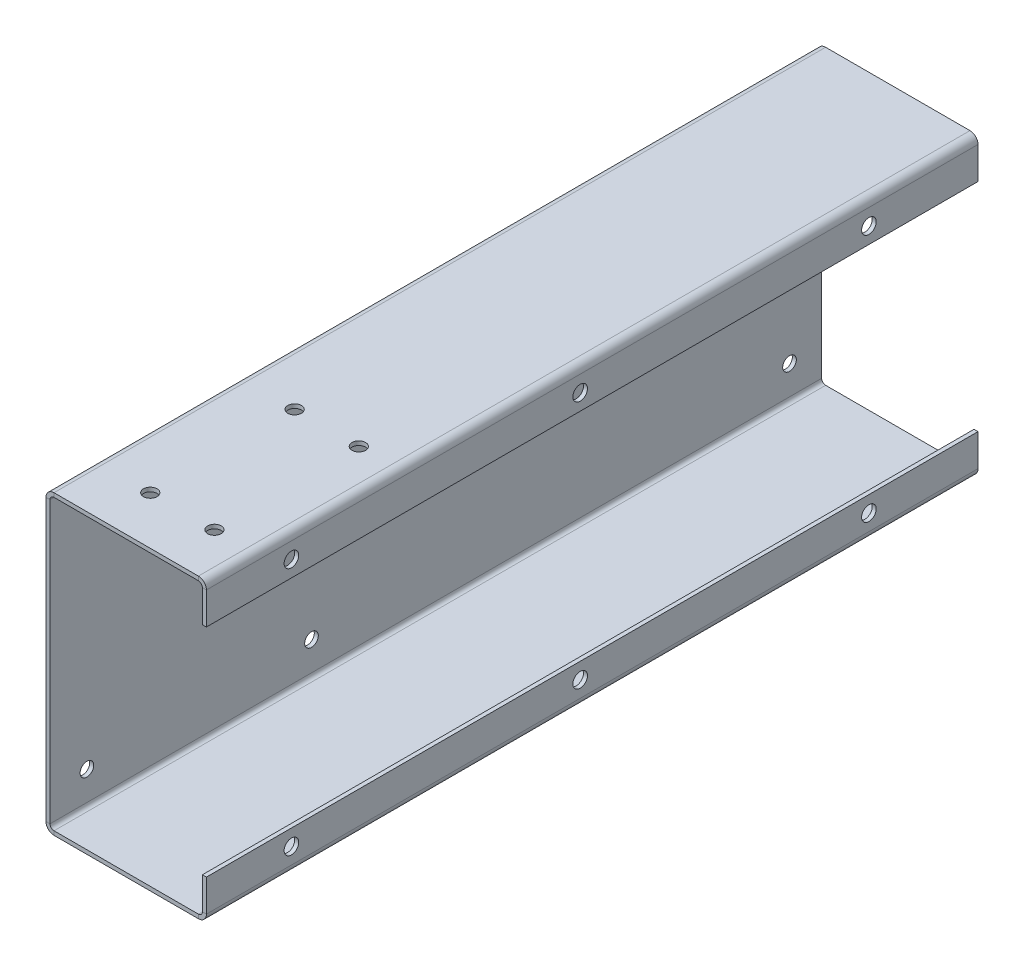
ISO-10303-21;
HEADER;
FILE_DESCRIPTION(('STEP AP214'),'2;1');
FILE_NAME('part.step','',(''),(''),'','','');
FILE_SCHEMA(('AUTOMOTIVE_DESIGN { 1 0 10303 214 1 1 1 1 }'));
ENDSEC;
DATA;
#1=APPLICATION_CONTEXT('core data for automotive mechanical design processes');
#2=APPLICATION_PROTOCOL_DEFINITION('international standard','automotive_design',2000,#1);
#3=PRODUCT_CONTEXT('',#1,'mechanical');
#4=PRODUCT('Part','Part','',(#3));
#5=PRODUCT_RELATED_PRODUCT_CATEGORY('part','',(#4));
#6=PRODUCT_DEFINITION_FORMATION('','',#4);
#7=PRODUCT_DEFINITION_CONTEXT('part definition',#1,'design');
#8=PRODUCT_DEFINITION('design','',#6,#7);
#9=PRODUCT_DEFINITION_SHAPE('','',#8);
#10=(LENGTH_UNIT() NAMED_UNIT(*) SI_UNIT(.MILLI.,.METRE.));
#11=(NAMED_UNIT(*) PLANE_ANGLE_UNIT() SI_UNIT($,.RADIAN.));
#12=(NAMED_UNIT(*) SI_UNIT($,.STERADIAN.) SOLID_ANGLE_UNIT());
#13=UNCERTAINTY_MEASURE_WITH_UNIT(LENGTH_MEASURE(1.E-05),#10,'distance_accuracy_value','');
#14=(GEOMETRIC_REPRESENTATION_CONTEXT(3) GLOBAL_UNCERTAINTY_ASSIGNED_CONTEXT((#13)) GLOBAL_UNIT_ASSIGNED_CONTEXT((#10,
#11,#12)) REPRESENTATION_CONTEXT('',''));
#15=CARTESIAN_POINT('',(0.,0.,0.));
#16=DIRECTION('',(0.,0.,1.));
#17=DIRECTION('',(1.,0.,0.));
#18=AXIS2_PLACEMENT_3D('',#15,#16,#17);
#19=CARTESIAN_POINT('',(2.50000000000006,0.,481.));
#20=DIRECTION('',(-1.,0.,0.));
#21=DIRECTION('',(0.,0.,1.));
#22=AXIS2_PLACEMENT_3D('',#19,#20,#21);
#23=PLANE('',#22);
#24=CARTESIAN_POINT('',(2.49999999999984,23.0000000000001,318.));
#25=DIRECTION('',(1.,0.,0.));
#26=DIRECTION('',(0.,0.,-1.));
#27=AXIS2_PLACEMENT_3D('',#24,#25,#26);
#28=CIRCLE('',#27,4.24999999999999);
#29=CARTESIAN_POINT('',(2.49999999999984,23.0000000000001,313.75));
#30=VERTEX_POINT('',#29);
#31=EDGE_CURVE('E506',#30,#30,#28,.T.);
#32=ORIENTED_EDGE('',*,*,#31,.F.);
#33=EDGE_LOOP('',(#32));
#34=FACE_BOUND('',#33,.T.);
#35=DIRECTION('',(0.,1.,0.));
#36=VECTOR('',#35,1.);
#37=CARTESIAN_POINT('',(2.5,0.,0.));
#38=LINE('',#37,#36);
#39=CARTESIAN_POINT('',(2.49999999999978,5.00000000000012,0.));
#40=VERTEX_POINT('',#39);
#41=CARTESIAN_POINT('',(2.5,180.,0.));
#42=VERTEX_POINT('',#41);
#43=EDGE_CURVE('E265',#40,#42,#38,.T.);
#44=ORIENTED_EDGE('',*,*,#43,.T.);
#45=DIRECTION('',(0.,0.,-1.));
#46=VECTOR('',#45,1.);
#47=CARTESIAN_POINT('',(2.49999999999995,180.,480.999999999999));
#48=LINE('',#47,#46);
#49=CARTESIAN_POINT('',(2.49999999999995,180.,480.999999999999));
#50=VERTEX_POINT('',#49);
#51=EDGE_CURVE('E365',#50,#42,#48,.T.);
#52=ORIENTED_EDGE('',*,*,#51,.F.);
#53=DIRECTION('',(0.,1.,0.));
#54=VECTOR('',#53,1.);
#55=CARTESIAN_POINT('',(2.50000000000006,0.,481.));
#56=LINE('',#55,#54);
#57=CARTESIAN_POINT('',(2.49999999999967,4.99999999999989,481.));
#58=VERTEX_POINT('',#57);
#59=EDGE_CURVE('E342',#58,#50,#56,.T.);
#60=ORIENTED_EDGE('',*,*,#59,.F.);
#61=DIRECTION('',(0.,0.,-1.));
#62=VECTOR('',#61,1.);
#63=CARTESIAN_POINT('',(2.49999999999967,4.99999999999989,481.));
#64=LINE('',#63,#62);
#65=EDGE_CURVE('E369',#58,#40,#64,.T.);
#66=ORIENTED_EDGE('',*,*,#65,.T.);
#67=EDGE_LOOP('',(#44,#52,#60,#66));
#68=FACE_BOUND('',#67,.T.);
#69=CARTESIAN_POINT('',(2.49999999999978,23.0000000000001,458.));
#70=DIRECTION('',(1.,0.,0.));
#71=DIRECTION('',(0.,0.,-1.));
#72=AXIS2_PLACEMENT_3D('',#69,#70,#71);
#73=CIRCLE('',#72,4.24999999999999);
#74=CARTESIAN_POINT('',(2.49999999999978,23.0000000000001,453.75));
#75=VERTEX_POINT('',#74);
#76=EDGE_CURVE('E514',#75,#75,#73,.T.);
#77=ORIENTED_EDGE('',*,*,#76,.F.);
#78=EDGE_LOOP('',(#77));
#79=FACE_BOUND('',#78,.T.);
#80=CARTESIAN_POINT('',(2.49999999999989,23.0000000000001,19.9999999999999));
#81=DIRECTION('',(1.,0.,0.));
#82=DIRECTION('',(0.,0.,-1.));
#83=AXIS2_PLACEMENT_3D('',#80,#81,#82);
#84=CIRCLE('',#83,4.24999999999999);
#85=CARTESIAN_POINT('',(2.49999999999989,23.0000000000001,15.7499999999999));
#86=VERTEX_POINT('',#85);
#87=EDGE_CURVE('E470',#86,#86,#84,.T.);
#88=ORIENTED_EDGE('',*,*,#87,.F.);
#89=EDGE_LOOP('',(#88));
#90=FACE_BOUND('',#89,.T.);
#91=ADVANCED_FACE('F38',(#34,#68,#79,#90),#23,.F.);
#92=CARTESIAN_POINT('',(95.,0.,481.));
#93=DIRECTION('',(0.,0.,1.));
#94=DIRECTION('',(1.,0.,0.));
#95=AXIS2_PLACEMENT_3D('',#92,#93,#94);
#96=PLANE('',#95);
#97=DIRECTION('',(0.,1.,0.));
#98=VECTOR('',#97,1.);
#99=CARTESIAN_POINT('',(95.,0.,481.));
#100=LINE('',#99,#98);
#101=CARTESIAN_POINT('',(95.,0.,481.));
#102=VERTEX_POINT('',#101);
#103=CARTESIAN_POINT('',(94.9999999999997,2.50000000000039,481.));
#104=VERTEX_POINT('',#103);
#105=EDGE_CURVE('E11',#102,#104,#100,.T.);
#106=ORIENTED_EDGE('',*,*,#105,.F.);
#107=CARTESIAN_POINT('',(94.9999999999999,5.00000000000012,481.));
#108=DIRECTION('',(0.,0.,1.));
#109=DIRECTION('',(1.,0.,0.));
#110=AXIS2_PLACEMENT_3D('',#107,#108,#109);
#111=CIRCLE('',#110,5.);
#112=CARTESIAN_POINT('',(99.9999999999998,4.99999999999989,481.));
#113=VERTEX_POINT('',#112);
#114=EDGE_CURVE('E314',#113,#102,#111,.F.);
#115=ORIENTED_EDGE('',*,*,#114,.F.);
#116=DIRECTION('',(1.,0.,0.));
#117=VECTOR('',#116,1.);
#118=CARTESIAN_POINT('',(97.4999999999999,5.00000000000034,481.));
#119=LINE('',#118,#117);
#120=CARTESIAN_POINT('',(97.4999999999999,5.00000000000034,481.));
#121=VERTEX_POINT('',#120);
#122=EDGE_CURVE('E48',#121,#113,#119,.T.);
#123=ORIENTED_EDGE('',*,*,#122,.F.);
#124=CARTESIAN_POINT('',(94.9999999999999,5.00000000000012,481.));
#125=DIRECTION('',(0.,0.,1.));
#126=DIRECTION('',(1.,0.,0.));
#127=AXIS2_PLACEMENT_3D('',#124,#125,#126);
#128=CIRCLE('',#127,2.5);
#129=EDGE_CURVE('E330',#121,#104,#128,.F.);
#130=ORIENTED_EDGE('',*,*,#129,.T.);
#131=EDGE_LOOP('',(#106,#115,#123,#130));
#132=FACE_BOUND('',#131,.T.);
#133=ADVANCED_FACE('F40',(#132),#96,.T.);
#134=CARTESIAN_POINT('',(97.4999999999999,5.00000000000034,481.));
#135=DIRECTION('',(0.,0.,1.));
#136=DIRECTION('',(1.,0.,0.));
#137=AXIS2_PLACEMENT_3D('',#134,#135,#136);
#138=PLANE('',#137);
#139=DIRECTION('',(-1.,0.,0.));
#140=VECTOR('',#139,1.);
#141=CARTESIAN_POINT('',(99.9999999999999,0.,481.));
#142=LINE('',#141,#140);
#143=CARTESIAN_POINT('',(5.00000000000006,0.,481.));
#144=VERTEX_POINT('',#143);
#145=EDGE_CURVE('E310',#102,#144,#142,.T.);
#146=ORIENTED_EDGE('',*,*,#145,.F.);
#147=ORIENTED_EDGE('',*,*,#105,.T.);
#148=DIRECTION('',(-1.,0.,0.));
#149=VECTOR('',#148,1.);
#150=CARTESIAN_POINT('',(99.9999999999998,2.49999999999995,481.));
#151=LINE('',#150,#149);
#152=CARTESIAN_POINT('',(4.99999999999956,2.49999999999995,481.));
#153=VERTEX_POINT('',#152);
#154=EDGE_CURVE('E334',#104,#153,#151,.T.);
#155=ORIENTED_EDGE('',*,*,#154,.T.);
#156=DIRECTION('',(0.,-1.,0.));
#157=VECTOR('',#156,1.);
#158=CARTESIAN_POINT('',(4.99999999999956,2.49999999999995,481.));
#159=LINE('',#158,#157);
#160=EDGE_CURVE('E452',#153,#144,#159,.T.);
#161=ORIENTED_EDGE('',*,*,#160,.T.);
#162=EDGE_LOOP('',(#146,#147,#155,#161));
#163=FACE_BOUND('',#162,.T.);
#164=ADVANCED_FACE('F660',(#163),#138,.T.);
#165=CARTESIAN_POINT('',(99.9999999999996,5.00000000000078,-3.33066907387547E-13));
#166=DIRECTION('',(0.,0.,-1.));
#167=DIRECTION('',(-1.,0.,0.));
#168=AXIS2_PLACEMENT_3D('',#165,#166,#167);
#169=PLANE('',#168);
#170=DIRECTION('',(-1.,0.,0.));
#171=VECTOR('',#170,1.);
#172=CARTESIAN_POINT('',(99.9999999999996,5.00000000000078,-3.33066907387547E-13));
#173=LINE('',#172,#171);
#174=CARTESIAN_POINT('',(99.9999999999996,5.00000000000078,-3.33066907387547E-13));
#175=VERTEX_POINT('',#174);
#176=CARTESIAN_POINT('',(97.4999999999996,5.00000000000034,-1.11022302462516E-13));
#177=VERTEX_POINT('',#176);
#178=EDGE_CURVE('E461',#175,#177,#173,.T.);
#179=ORIENTED_EDGE('',*,*,#178,.F.);
#180=CARTESIAN_POINT('',(94.9999999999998,5.00000000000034,-1.66533453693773E-13));
#181=DIRECTION('',(0.,0.,1.));
#182=DIRECTION('',(1.,0.,0.));
#183=AXIS2_PLACEMENT_3D('',#180,#181,#182);
#184=CIRCLE('',#183,5.);
#185=CARTESIAN_POINT('',(95.0000000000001,2.22044604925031E-13,0.));
#186=VERTEX_POINT('',#185);
#187=EDGE_CURVE('E237',#175,#186,#184,.F.);
#188=ORIENTED_EDGE('',*,*,#187,.T.);
#189=DIRECTION('',(0.,-1.,0.));
#190=VECTOR('',#189,1.);
#191=CARTESIAN_POINT('',(94.9999999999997,2.50000000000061,-1.66533453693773E-13));
#192=LINE('',#191,#190);
#193=CARTESIAN_POINT('',(94.9999999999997,2.50000000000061,-1.66533453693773E-13));
#194=VERTEX_POINT('',#193);
#195=EDGE_CURVE('E458',#194,#186,#192,.T.);
#196=ORIENTED_EDGE('',*,*,#195,.F.);
#197=CARTESIAN_POINT('',(94.9999999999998,5.00000000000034,-1.66533453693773E-13));
#198=DIRECTION('',(0.,0.,1.));
#199=DIRECTION('',(1.,0.,0.));
#200=AXIS2_PLACEMENT_3D('',#197,#198,#199);
#201=CIRCLE('',#200,2.5);
#202=EDGE_CURVE('E253',#177,#194,#201,.F.);
#203=ORIENTED_EDGE('',*,*,#202,.F.);
#204=EDGE_LOOP('',(#179,#188,#196,#203));
#205=FACE_BOUND('',#204,.T.);
#206=ADVANCED_FACE('F630',(#205),#169,.T.);
#207=CARTESIAN_POINT('',(94.9999999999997,2.50000000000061,-1.66533453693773E-13));
#208=DIRECTION('',(0.,0.,-1.));
#209=DIRECTION('',(-1.,0.,0.));
#210=AXIS2_PLACEMENT_3D('',#207,#208,#209);
#211=PLANE('',#210);
#212=DIRECTION('',(0.,-1.,0.));
#213=VECTOR('',#212,1.);
#214=CARTESIAN_POINT('',(100.,25.0000000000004,-1.66533453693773E-13));
#215=LINE('',#214,#213);
#216=CARTESIAN_POINT('',(100.,25.0000000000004,-1.66533453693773E-13));
#217=VERTEX_POINT('',#216);
#218=EDGE_CURVE('E241',#217,#175,#215,.T.);
#219=ORIENTED_EDGE('',*,*,#218,.T.);
#220=ORIENTED_EDGE('',*,*,#178,.T.);
#221=DIRECTION('',(0.,1.,0.));
#222=VECTOR('',#221,1.);
#223=CARTESIAN_POINT('',(97.5,25.0000000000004,0.));
#224=LINE('',#223,#222);
#225=CARTESIAN_POINT('',(97.5,25.0000000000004,0.));
#226=VERTEX_POINT('',#225);
#227=EDGE_CURVE('E249',#226,#177,#224,.F.);
#228=ORIENTED_EDGE('',*,*,#227,.F.);
#229=DIRECTION('',(1.,0.,0.));
#230=VECTOR('',#229,1.);
#231=CARTESIAN_POINT('',(97.5,25.0000000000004,0.));
#232=LINE('',#231,#230);
#233=EDGE_CURVE('E245',#226,#217,#232,.T.);
#234=ORIENTED_EDGE('',*,*,#233,.T.);
#235=EDGE_LOOP('',(#219,#220,#228,#234));
#236=FACE_BOUND('',#235,.T.);
#237=ADVANCED_FACE('F638',(#236),#211,.T.);
#238=CARTESIAN_POINT('',(-2.77555756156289E-13,5.00000000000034,481.));
#239=DIRECTION('',(0.,0.,1.));
#240=DIRECTION('',(1.,0.,0.));
#241=AXIS2_PLACEMENT_3D('',#238,#239,#240);
#242=PLANE('',#241);
#243=DIRECTION('',(1.,0.,0.));
#244=VECTOR('',#243,1.);
#245=CARTESIAN_POINT('',(-2.77555756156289E-13,5.00000000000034,481.));
#246=LINE('',#245,#244);
#247=CARTESIAN_POINT('',(-2.77555756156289E-13,5.00000000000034,481.));
#248=VERTEX_POINT('',#247);
#249=EDGE_CURVE('E455',#248,#58,#246,.T.);
#250=ORIENTED_EDGE('',*,*,#249,.F.);
#251=CARTESIAN_POINT('',(4.99999999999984,5.00000000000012,481.));
#252=DIRECTION('',(0.,0.,1.));
#253=DIRECTION('',(1.,0.,0.));
#254=AXIS2_PLACEMENT_3D('',#251,#252,#253);
#255=CIRCLE('',#254,5.);
#256=EDGE_CURVE('E306',#144,#248,#255,.F.);
#257=ORIENTED_EDGE('',*,*,#256,.F.);
#258=ORIENTED_EDGE('',*,*,#160,.F.);
#259=CARTESIAN_POINT('',(4.99999999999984,5.00000000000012,481.));
#260=DIRECTION('',(0.,0.,1.));
#261=DIRECTION('',(1.,0.,0.));
#262=AXIS2_PLACEMENT_3D('',#259,#260,#261);
#263=CIRCLE('',#262,2.5);
#264=EDGE_CURVE('E338',#153,#58,#263,.F.);
#265=ORIENTED_EDGE('',*,*,#264,.T.);
#266=EDGE_LOOP('',(#250,#257,#258,#265));
#267=FACE_BOUND('',#266,.T.);
#268=ADVANCED_FACE('F663',(#267),#242,.T.);
#269=CARTESIAN_POINT('',(4.99999999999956,2.49999999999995,481.));
#270=DIRECTION('',(0.,0.,1.));
#271=DIRECTION('',(1.,0.,0.));
#272=AXIS2_PLACEMENT_3D('',#269,#270,#271);
#273=PLANE('',#272);
#274=DIRECTION('',(0.,1.,0.));
#275=VECTOR('',#274,1.);
#276=CARTESIAN_POINT('',(-1.11022302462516E-13,0.,481.));
#277=LINE('',#276,#275);
#278=CARTESIAN_POINT('',(0.,180.,481.));
#279=VERTEX_POINT('',#278);
#280=EDGE_CURVE('E302',#248,#279,#277,.T.);
#281=ORIENTED_EDGE('',*,*,#280,.F.);
#282=ORIENTED_EDGE('',*,*,#249,.T.);
#283=ORIENTED_EDGE('',*,*,#59,.T.);
#284=DIRECTION('',(-1.,0.,0.));
#285=VECTOR('',#284,1.);
#286=CARTESIAN_POINT('',(2.49999999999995,180.,480.999999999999));
#287=LINE('',#286,#285);
#288=EDGE_CURVE('E440',#50,#279,#287,.T.);
#289=ORIENTED_EDGE('',*,*,#288,.T.);
#290=EDGE_LOOP('',(#281,#282,#283,#289));
#291=FACE_BOUND('',#290,.T.);
#292=ADVANCED_FACE('F667',(#291),#273,.T.);
#293=CARTESIAN_POINT('',(5.00000000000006,0.,-1.66533453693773E-13));
#294=DIRECTION('',(0.,0.,-1.));
#295=DIRECTION('',(-1.,0.,0.));
#296=AXIS2_PLACEMENT_3D('',#293,#294,#295);
#297=PLANE('',#296);
#298=DIRECTION('',(0.,1.,0.));
#299=VECTOR('',#298,1.);
#300=CARTESIAN_POINT('',(5.00000000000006,0.,-1.66533453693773E-13));
#301=LINE('',#300,#299);
#302=CARTESIAN_POINT('',(5.00000000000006,0.,-1.66533453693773E-13));
#303=VERTEX_POINT('',#302);
#304=CARTESIAN_POINT('',(4.99999999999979,2.49999999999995,-1.11022302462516E-13));
#305=VERTEX_POINT('',#304);
#306=EDGE_CURVE('E449',#303,#305,#301,.T.);
#307=ORIENTED_EDGE('',*,*,#306,.F.);
#308=CARTESIAN_POINT('',(4.99999999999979,5.00000000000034,0.));
#309=DIRECTION('',(0.,0.,1.));
#310=DIRECTION('',(1.,0.,0.));
#311=AXIS2_PLACEMENT_3D('',#308,#309,#310);
#312=CIRCLE('',#311,5.);
#313=CARTESIAN_POINT('',(-2.22044604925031E-13,5.00000000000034,-2.22044604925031E-13));
#314=VERTEX_POINT('',#313);
#315=EDGE_CURVE('E229',#303,#314,#312,.F.);
#316=ORIENTED_EDGE('',*,*,#315,.T.);
#317=DIRECTION('',(-1.,0.,0.));
#318=VECTOR('',#317,1.);
#319=CARTESIAN_POINT('',(2.49999999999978,5.00000000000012,0.));
#320=LINE('',#319,#318);
#321=EDGE_CURVE('E446',#40,#314,#320,.T.);
#322=ORIENTED_EDGE('',*,*,#321,.F.);
#323=CARTESIAN_POINT('',(4.99999999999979,5.00000000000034,0.));
#324=DIRECTION('',(0.,0.,1.));
#325=DIRECTION('',(1.,0.,0.));
#326=AXIS2_PLACEMENT_3D('',#323,#324,#325);
#327=CIRCLE('',#326,2.5);
#328=EDGE_CURVE('E261',#305,#40,#327,.F.);
#329=ORIENTED_EDGE('',*,*,#328,.F.);
#330=EDGE_LOOP('',(#307,#316,#322,#329));
#331=FACE_BOUND('',#330,.T.);
#332=ADVANCED_FACE('F614',(#331),#297,.T.);
#333=CARTESIAN_POINT('',(2.49999999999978,5.00000000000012,0.));
#334=DIRECTION('',(0.,0.,-1.));
#335=DIRECTION('',(-1.,0.,0.));
#336=AXIS2_PLACEMENT_3D('',#333,#334,#335);
#337=PLANE('',#336);
#338=DIRECTION('',(-1.,0.,0.));
#339=VECTOR('',#338,1.);
#340=CARTESIAN_POINT('',(99.9999999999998,4.44089209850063E-13,0.));
#341=LINE('',#340,#339);
#342=EDGE_CURVE('E233',#186,#303,#341,.T.);
#343=ORIENTED_EDGE('',*,*,#342,.T.);
#344=ORIENTED_EDGE('',*,*,#306,.T.);
#345=DIRECTION('',(-1.,0.,0.));
#346=VECTOR('',#345,1.);
#347=CARTESIAN_POINT('',(99.9999999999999,2.50000000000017,0.));
#348=LINE('',#347,#346);
#349=EDGE_CURVE('E257',#194,#305,#348,.T.);
#350=ORIENTED_EDGE('',*,*,#349,.F.);
#351=ORIENTED_EDGE('',*,*,#195,.T.);
#352=EDGE_LOOP('',(#343,#344,#350,#351));
#353=FACE_BOUND('',#352,.T.);
#354=ADVANCED_FACE('F622',(#353),#337,.T.);
#355=CARTESIAN_POINT('',(5.00000000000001,185.,481.));
#356=DIRECTION('',(0.,0.,1.));
#357=DIRECTION('',(1.,0.,0.));
#358=AXIS2_PLACEMENT_3D('',#355,#356,#357);
#359=PLANE('',#358);
#360=DIRECTION('',(0.,-1.,0.));
#361=VECTOR('',#360,1.);
#362=CARTESIAN_POINT('',(5.00000000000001,185.,481.));
#363=LINE('',#362,#361);
#364=CARTESIAN_POINT('',(5.00000000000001,185.,481.));
#365=VERTEX_POINT('',#364);
#366=CARTESIAN_POINT('',(5.00000000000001,182.5,481.));
#367=VERTEX_POINT('',#366);
#368=EDGE_CURVE('E443',#365,#367,#363,.T.);
#369=ORIENTED_EDGE('',*,*,#368,.F.);
#370=CARTESIAN_POINT('',(5.00000000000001,180.,481.));
#371=DIRECTION('',(0.,0.,1.));
#372=DIRECTION('',(1.,0.,0.));
#373=AXIS2_PLACEMENT_3D('',#370,#371,#372);
#374=CIRCLE('',#373,5.);
#375=EDGE_CURVE('E298',#279,#365,#374,.F.);
#376=ORIENTED_EDGE('',*,*,#375,.F.);
#377=ORIENTED_EDGE('',*,*,#288,.F.);
#378=CARTESIAN_POINT('',(5.00000000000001,180.,481.));
#379=DIRECTION('',(0.,0.,1.));
#380=DIRECTION('',(1.,0.,0.));
#381=AXIS2_PLACEMENT_3D('',#378,#379,#380);
#382=CIRCLE('',#381,2.5);
#383=EDGE_CURVE('E346',#50,#367,#382,.F.);
#384=ORIENTED_EDGE('',*,*,#383,.T.);
#385=EDGE_LOOP('',(#369,#376,#377,#384));
#386=FACE_BOUND('',#385,.T.);
#387=ADVANCED_FACE('F671',(#386),#359,.T.);
#388=CARTESIAN_POINT('',(2.49999999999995,180.,480.999999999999));
#389=DIRECTION('',(0.,0.,1.));
#390=DIRECTION('',(1.,0.,0.));
#391=AXIS2_PLACEMENT_3D('',#388,#389,#390);
#392=PLANE('',#391);
#393=DIRECTION('',(1.,0.,0.));
#394=VECTOR('',#393,1.);
#395=CARTESIAN_POINT('',(1.11022302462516E-13,185.,481.));
#396=LINE('',#395,#394);
#397=CARTESIAN_POINT('',(95.0000000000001,185.,481.));
#398=VERTEX_POINT('',#397);
#399=EDGE_CURVE('E294',#365,#398,#396,.T.);
#400=ORIENTED_EDGE('',*,*,#399,.F.);
#401=ORIENTED_EDGE('',*,*,#368,.T.);
#402=DIRECTION('',(1.,0.,0.));
#403=VECTOR('',#402,1.);
#404=CARTESIAN_POINT('',(-2.22044604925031E-13,182.5,480.999999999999));
#405=LINE('',#404,#403);
#406=CARTESIAN_POINT('',(95.0000000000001,182.5,480.999999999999));
#407=VERTEX_POINT('',#406);
#408=EDGE_CURVE('E350',#367,#407,#405,.T.);
#409=ORIENTED_EDGE('',*,*,#408,.T.);
#410=DIRECTION('',(0.,1.,0.));
#411=VECTOR('',#410,1.);
#412=CARTESIAN_POINT('',(95.0000000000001,182.5,480.999999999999));
#413=LINE('',#412,#411);
#414=EDGE_CURVE('E63',#407,#398,#413,.T.);
#415=ORIENTED_EDGE('',*,*,#414,.T.);
#416=EDGE_LOOP('',(#400,#401,#409,#415));
#417=FACE_BOUND('',#416,.T.);
#418=ADVANCED_FACE('F675',(#417),#392,.T.);
#419=CARTESIAN_POINT('',(0.,180.,-2.22044604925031E-13));
#420=DIRECTION('',(0.,0.,-1.));
#421=DIRECTION('',(-1.,0.,0.));
#422=AXIS2_PLACEMENT_3D('',#419,#420,#421);
#423=PLANE('',#422);
#424=DIRECTION('',(1.,0.,0.));
#425=VECTOR('',#424,1.);
#426=CARTESIAN_POINT('',(0.,180.,-2.22044604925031E-13));
#427=LINE('',#426,#425);
#428=CARTESIAN_POINT('',(0.,180.,-2.22044604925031E-13));
#429=VERTEX_POINT('',#428);
#430=EDGE_CURVE('E437',#429,#42,#427,.T.);
#431=ORIENTED_EDGE('',*,*,#430,.F.);
#432=CARTESIAN_POINT('',(5.00000000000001,180.,-1.66533453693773E-13));
#433=DIRECTION('',(0.,0.,1.));
#434=DIRECTION('',(1.,0.,0.));
#435=AXIS2_PLACEMENT_3D('',#432,#433,#434);
#436=CIRCLE('',#435,5.);
#437=CARTESIAN_POINT('',(4.99999999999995,185.,0.));
#438=VERTEX_POINT('',#437);
#439=EDGE_CURVE('E221',#429,#438,#436,.F.);
#440=ORIENTED_EDGE('',*,*,#439,.T.);
#441=DIRECTION('',(0.,1.,0.));
#442=VECTOR('',#441,1.);
#443=CARTESIAN_POINT('',(5.00000000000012,182.5,-1.66533453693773E-13));
#444=LINE('',#443,#442);
#445=CARTESIAN_POINT('',(5.00000000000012,182.5,-1.66533453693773E-13));
#446=VERTEX_POINT('',#445);
#447=EDGE_CURVE('E434',#446,#438,#444,.T.);
#448=ORIENTED_EDGE('',*,*,#447,.F.);
#449=CARTESIAN_POINT('',(5.00000000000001,180.,-1.66533453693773E-13));
#450=DIRECTION('',(0.,0.,1.));
#451=DIRECTION('',(1.,0.,0.));
#452=AXIS2_PLACEMENT_3D('',#449,#450,#451);
#453=CIRCLE('',#452,2.5);
#454=EDGE_CURVE('E269',#42,#446,#453,.F.);
#455=ORIENTED_EDGE('',*,*,#454,.F.);
#456=EDGE_LOOP('',(#431,#440,#448,#455));
#457=FACE_BOUND('',#456,.T.);
#458=ADVANCED_FACE('F598',(#457),#423,.T.);
#459=CARTESIAN_POINT('',(5.00000000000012,182.5,-1.66533453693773E-13));
#460=DIRECTION('',(0.,0.,-1.));
#461=DIRECTION('',(-1.,0.,0.));
#462=AXIS2_PLACEMENT_3D('',#459,#460,#461);
#463=PLANE('',#462);
#464=DIRECTION('',(0.,1.,0.));
#465=VECTOR('',#464,1.);
#466=CARTESIAN_POINT('',(0.,0.,0.));
#467=LINE('',#466,#465);
#468=EDGE_CURVE('E225',#314,#429,#467,.T.);
#469=ORIENTED_EDGE('',*,*,#468,.T.);
#470=ORIENTED_EDGE('',*,*,#430,.T.);
#471=ORIENTED_EDGE('',*,*,#43,.F.);
#472=ORIENTED_EDGE('',*,*,#321,.T.);
#473=EDGE_LOOP('',(#469,#470,#471,#472));
#474=FACE_BOUND('',#473,.T.);
#475=ADVANCED_FACE('F606',(#474),#463,.T.);
#476=CARTESIAN_POINT('',(99.9999999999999,180.,481.));
#477=DIRECTION('',(0.,0.,1.));
#478=DIRECTION('',(1.,0.,0.));
#479=AXIS2_PLACEMENT_3D('',#476,#477,#478);
#480=PLANE('',#479);
#481=DIRECTION('',(-1.,0.,0.));
#482=VECTOR('',#481,1.);
#483=CARTESIAN_POINT('',(99.9999999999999,180.,481.));
#484=LINE('',#483,#482);
#485=CARTESIAN_POINT('',(99.9999999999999,180.,481.));
#486=VERTEX_POINT('',#485);
#487=CARTESIAN_POINT('',(97.5000000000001,180.,481.));
#488=VERTEX_POINT('',#487);
#489=EDGE_CURVE('E56',#486,#488,#484,.T.);
#490=ORIENTED_EDGE('',*,*,#489,.F.);
#491=CARTESIAN_POINT('',(95.0000000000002,180.,480.999999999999));
#492=DIRECTION('',(0.,0.,1.));
#493=DIRECTION('',(1.,0.,0.));
#494=AXIS2_PLACEMENT_3D('',#491,#492,#493);
#495=CIRCLE('',#494,5.);
#496=EDGE_CURVE('E290',#398,#486,#495,.F.);
#497=ORIENTED_EDGE('',*,*,#496,.F.);
#498=ORIENTED_EDGE('',*,*,#414,.F.);
#499=CARTESIAN_POINT('',(95.0000000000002,180.,480.999999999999));
#500=DIRECTION('',(0.,0.,1.));
#501=DIRECTION('',(1.,0.,0.));
#502=AXIS2_PLACEMENT_3D('',#499,#500,#501);
#503=CIRCLE('',#502,2.5);
#504=EDGE_CURVE('E353',#407,#488,#503,.F.);
#505=ORIENTED_EDGE('',*,*,#504,.T.);
#506=EDGE_LOOP('',(#490,#497,#498,#505));
#507=FACE_BOUND('',#506,.T.);
#508=ADVANCED_FACE('F683',(#507),#480,.T.);
#509=CARTESIAN_POINT('',(95.0000000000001,182.5,480.999999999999));
#510=DIRECTION('',(0.,0.,1.));
#511=DIRECTION('',(1.,0.,0.));
#512=AXIS2_PLACEMENT_3D('',#509,#510,#511);
#513=PLANE('',#512);
#514=DIRECTION('',(0.,-1.,0.));
#515=VECTOR('',#514,1.);
#516=CARTESIAN_POINT('',(100.,185.,480.999999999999));
#517=LINE('',#516,#515);
#518=CARTESIAN_POINT('',(100.,160.,481.));
#519=VERTEX_POINT('',#518);
#520=EDGE_CURVE('E286',#486,#519,#517,.T.);
#521=ORIENTED_EDGE('',*,*,#520,.F.);
#522=ORIENTED_EDGE('',*,*,#489,.T.);
#523=DIRECTION('',(0.,1.,0.));
#524=VECTOR('',#523,1.);
#525=CARTESIAN_POINT('',(97.5,185.,481.));
#526=LINE('',#525,#524);
#527=CARTESIAN_POINT('',(97.4999999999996,160.,481.));
#528=VERTEX_POINT('',#527);
#529=EDGE_CURVE('E281',#488,#528,#526,.F.);
#530=ORIENTED_EDGE('',*,*,#529,.T.);
#531=DIRECTION('',(-1.,0.,0.));
#532=VECTOR('',#531,1.);
#533=CARTESIAN_POINT('',(100.,160.,481.));
#534=LINE('',#533,#532);
#535=EDGE_CURVE('E185',#519,#528,#534,.T.);
#536=ORIENTED_EDGE('',*,*,#535,.F.);
#537=EDGE_LOOP('',(#521,#522,#530,#536));
#538=FACE_BOUND('',#537,.T.);
#539=ADVANCED_FACE('F685',(#538),#513,.T.);
#540=CARTESIAN_POINT('',(95.,185.000000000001,-1.66533453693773E-13));
#541=DIRECTION('',(0.,0.,-1.));
#542=DIRECTION('',(-1.,0.,0.));
#543=AXIS2_PLACEMENT_3D('',#540,#541,#542);
#544=PLANE('',#543);
#545=DIRECTION('',(0.,-1.,0.));
#546=VECTOR('',#545,1.);
#547=CARTESIAN_POINT('',(95.,185.000000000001,-1.66533453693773E-13));
#548=LINE('',#547,#546);
#549=CARTESIAN_POINT('',(95.,185.000000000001,-1.66533453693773E-13));
#550=VERTEX_POINT('',#549);
#551=CARTESIAN_POINT('',(95.0000000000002,182.5,-2.22044604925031E-13));
#552=VERTEX_POINT('',#551);
#553=EDGE_CURVE('E427',#550,#552,#548,.T.);
#554=ORIENTED_EDGE('',*,*,#553,.F.);
#555=CARTESIAN_POINT('',(95.0000000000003,180.,0.));
#556=DIRECTION('',(0.,0.,1.));
#557=DIRECTION('',(1.,0.,0.));
#558=AXIS2_PLACEMENT_3D('',#555,#556,#557);
#559=CIRCLE('',#558,5.);
#560=CARTESIAN_POINT('',(100.,180.,0.));
#561=VERTEX_POINT('',#560);
#562=EDGE_CURVE('E210',#550,#561,#559,.F.);
#563=ORIENTED_EDGE('',*,*,#562,.T.);
#564=DIRECTION('',(1.,0.,0.));
#565=VECTOR('',#564,1.);
#566=CARTESIAN_POINT('',(97.5000000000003,180.,-1.66533453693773E-13));
#567=LINE('',#566,#565);
#568=CARTESIAN_POINT('',(97.5000000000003,180.,-1.66533453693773E-13));
#569=VERTEX_POINT('',#568);
#570=EDGE_CURVE('E189',#569,#561,#567,.T.);
#571=ORIENTED_EDGE('',*,*,#570,.F.);
#572=CARTESIAN_POINT('',(95.0000000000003,180.,0.));
#573=DIRECTION('',(0.,0.,1.));
#574=DIRECTION('',(1.,0.,0.));
#575=AXIS2_PLACEMENT_3D('',#572,#573,#574);
#576=CIRCLE('',#575,2.5);
#577=EDGE_CURVE('E277',#552,#569,#576,.F.);
#578=ORIENTED_EDGE('',*,*,#577,.F.);
#579=EDGE_LOOP('',(#554,#563,#571,#578));
#580=FACE_BOUND('',#579,.T.);
#581=ADVANCED_FACE('F584',(#580),#544,.T.);
#582=CARTESIAN_POINT('',(97.5000000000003,180.,-1.66533453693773E-13));
#583=DIRECTION('',(0.,0.,-1.));
#584=DIRECTION('',(-1.,0.,0.));
#585=AXIS2_PLACEMENT_3D('',#582,#583,#584);
#586=PLANE('',#585);
#587=DIRECTION('',(1.,0.,0.));
#588=VECTOR('',#587,1.);
#589=CARTESIAN_POINT('',(0.,185.,0.));
#590=LINE('',#589,#588);
#591=EDGE_CURVE('E217',#438,#550,#590,.T.);
#592=ORIENTED_EDGE('',*,*,#591,.T.);
#593=ORIENTED_EDGE('',*,*,#553,.T.);
#594=DIRECTION('',(1.,0.,0.));
#595=VECTOR('',#594,1.);
#596=CARTESIAN_POINT('',(-2.22044604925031E-13,182.5,-1.66533453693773E-13));
#597=LINE('',#596,#595);
#598=EDGE_CURVE('E273',#446,#552,#597,.T.);
#599=ORIENTED_EDGE('',*,*,#598,.F.);
#600=ORIENTED_EDGE('',*,*,#447,.T.);
#601=EDGE_LOOP('',(#592,#593,#599,#600));
#602=FACE_BOUND('',#601,.T.);
#603=ADVANCED_FACE('F590',(#602),#586,.T.);
#604=CARTESIAN_POINT('',(97.5,185.,481.));
#605=DIRECTION('',(1.,0.,0.));
#606=DIRECTION('',(0.,0.,-1.));
#607=AXIS2_PLACEMENT_3D('',#604,#605,#606);
#608=PLANE('',#607);
#609=CARTESIAN_POINT('',(97.5,170.,428.));
#610=DIRECTION('',(1.,0.,0.));
#611=DIRECTION('',(0.,0.,-1.));
#612=AXIS2_PLACEMENT_3D('',#609,#610,#611);
#613=CIRCLE('',#612,4.55);
#614=CARTESIAN_POINT('',(97.5,170.,423.45));
#615=VERTEX_POINT('',#614);
#616=EDGE_CURVE('E548',#615,#615,#613,.T.);
#617=ORIENTED_EDGE('',*,*,#616,.T.);
#618=EDGE_LOOP('',(#617));
#619=FACE_BOUND('',#618,.T.);
#620=CARTESIAN_POINT('',(97.4999999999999,170.,248.));
#621=DIRECTION('',(1.,0.,0.));
#622=DIRECTION('',(0.,0.,-1.));
#623=AXIS2_PLACEMENT_3D('',#620,#621,#622);
#624=CIRCLE('',#623,4.55);
#625=CARTESIAN_POINT('',(97.4999999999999,170.,243.45));
#626=VERTEX_POINT('',#625);
#627=EDGE_CURVE('E556',#626,#626,#624,.T.);
#628=ORIENTED_EDGE('',*,*,#627,.T.);
#629=EDGE_LOOP('',(#628));
#630=FACE_BOUND('',#629,.T.);
#631=CARTESIAN_POINT('',(97.5,170.,67.9999999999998));
#632=DIRECTION('',(1.,0.,0.));
#633=DIRECTION('',(0.,0.,-1.));
#634=AXIS2_PLACEMENT_3D('',#631,#632,#633);
#635=CIRCLE('',#634,4.55);
#636=CARTESIAN_POINT('',(97.5,170.,63.4499999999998));
#637=VERTEX_POINT('',#636);
#638=EDGE_CURVE('E200',#637,#637,#635,.T.);
#639=ORIENTED_EDGE('',*,*,#638,.T.);
#640=EDGE_LOOP('',(#639));
#641=FACE_BOUND('',#640,.T.);
#642=DIRECTION('',(0.,1.,0.));
#643=VECTOR('',#642,1.);
#644=CARTESIAN_POINT('',(97.5000000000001,185.,0.));
#645=LINE('',#644,#643);
#646=CARTESIAN_POINT('',(97.4999999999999,160.000000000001,-1.66533453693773E-13));
#647=VERTEX_POINT('',#646);
#648=EDGE_CURVE('E194',#569,#647,#645,.F.);
#649=ORIENTED_EDGE('',*,*,#648,.T.);
#650=DIRECTION('',(0.,0.,-1.));
#651=VECTOR('',#650,1.);
#652=CARTESIAN_POINT('',(97.4999999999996,160.,481.));
#653=LINE('',#652,#651);
#654=EDGE_CURVE('E178',#528,#647,#653,.T.);
#655=ORIENTED_EDGE('',*,*,#654,.F.);
#656=ORIENTED_EDGE('',*,*,#529,.F.);
#657=DIRECTION('',(0.,0.,-1.));
#658=VECTOR('',#657,1.);
#659=CARTESIAN_POINT('',(97.5000000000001,180.,481.));
#660=LINE('',#659,#658);
#661=EDGE_CURVE('E197',#488,#569,#660,.T.);
#662=ORIENTED_EDGE('',*,*,#661,.T.);
#663=EDGE_LOOP('',(#649,#655,#656,#662));
#664=FACE_BOUND('',#663,.T.);
#665=ADVANCED_FACE('F195',(#619,#630,#641,#664),#608,.F.);
#666=CARTESIAN_POINT('',(100.,160.,481.));
#667=DIRECTION('',(0.,-1.,0.));
#668=DIRECTION('',(0.,0.,-1.));
#669=AXIS2_PLACEMENT_3D('',#666,#667,#668);
#670=PLANE('',#669);
#671=DIRECTION('',(-1.,0.,0.));
#672=VECTOR('',#671,1.);
#673=CARTESIAN_POINT('',(99.9999999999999,160.,0.));
#674=LINE('',#673,#672);
#675=CARTESIAN_POINT('',(99.9999999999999,160.,0.));
#676=VERTEX_POINT('',#675);
#677=EDGE_CURVE('E182',#676,#647,#674,.T.);
#678=ORIENTED_EDGE('',*,*,#677,.F.);
#679=DIRECTION('',(0.,0.,-1.));
#680=VECTOR('',#679,1.);
#681=CARTESIAN_POINT('',(100.,160.,481.));
#682=LINE('',#681,#680);
#683=EDGE_CURVE('E190',#519,#676,#682,.T.);
#684=ORIENTED_EDGE('',*,*,#683,.F.);
#685=ORIENTED_EDGE('',*,*,#535,.T.);
#686=ORIENTED_EDGE('',*,*,#654,.T.);
#687=EDGE_LOOP('',(#678,#684,#685,#686));
#688=FACE_BOUND('',#687,.T.);
#689=ADVANCED_FACE('F180',(#688),#670,.T.);
#690=CARTESIAN_POINT('',(100.,185.,480.999999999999));
#691=DIRECTION('',(1.,0.,0.));
#692=DIRECTION('',(0.,0.,-1.));
#693=AXIS2_PLACEMENT_3D('',#690,#691,#692);
#694=PLANE('',#693);
#695=CARTESIAN_POINT('',(100.,170.,428.));
#696=DIRECTION('',(1.,0.,0.));
#697=DIRECTION('',(0.,0.,-1.));
#698=AXIS2_PLACEMENT_3D('',#695,#696,#697);
#699=CIRCLE('',#698,4.55);
#700=CARTESIAN_POINT('',(100.,170.,423.45));
#701=VERTEX_POINT('',#700);
#702=EDGE_CURVE('E544',#701,#701,#699,.T.);
#703=ORIENTED_EDGE('',*,*,#702,.F.);
#704=EDGE_LOOP('',(#703));
#705=FACE_BOUND('',#704,.T.);
#706=CARTESIAN_POINT('',(100.,170.,248.));
#707=DIRECTION('',(1.,0.,0.));
#708=DIRECTION('',(0.,0.,-1.));
#709=AXIS2_PLACEMENT_3D('',#706,#707,#708);
#710=CIRCLE('',#709,4.55);
#711=CARTESIAN_POINT('',(100.,170.,243.45));
#712=VERTEX_POINT('',#711);
#713=EDGE_CURVE('E552',#712,#712,#710,.T.);
#714=ORIENTED_EDGE('',*,*,#713,.F.);
#715=EDGE_LOOP('',(#714));
#716=FACE_BOUND('',#715,.T.);
#717=CARTESIAN_POINT('',(100.,170.,67.9999999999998));
#718=DIRECTION('',(1.,0.,0.));
#719=DIRECTION('',(0.,0.,-1.));
#720=AXIS2_PLACEMENT_3D('',#717,#718,#719);
#721=CIRCLE('',#720,4.55);
#722=CARTESIAN_POINT('',(100.,170.,63.4499999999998));
#723=VERTEX_POINT('',#722);
#724=EDGE_CURVE('E560',#723,#723,#721,.T.);
#725=ORIENTED_EDGE('',*,*,#724,.F.);
#726=EDGE_LOOP('',(#725));
#727=FACE_BOUND('',#726,.T.);
#728=DIRECTION('',(0.,-1.,0.));
#729=VECTOR('',#728,1.);
#730=CARTESIAN_POINT('',(99.9999999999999,185.,-2.22044604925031E-13));
#731=LINE('',#730,#729);
#732=EDGE_CURVE('E204',#561,#676,#731,.T.);
#733=ORIENTED_EDGE('',*,*,#732,.F.);
#734=DIRECTION('',(0.,0.,-1.));
#735=VECTOR('',#734,1.);
#736=CARTESIAN_POINT('',(99.9999999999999,180.,481.));
#737=LINE('',#736,#735);
#738=EDGE_CURVE('E419',#486,#561,#737,.T.);
#739=ORIENTED_EDGE('',*,*,#738,.F.);
#740=ORIENTED_EDGE('',*,*,#520,.T.);
#741=ORIENTED_EDGE('',*,*,#683,.T.);
#742=EDGE_LOOP('',(#733,#739,#740,#741));
#743=FACE_BOUND('',#742,.T.);
#744=ADVANCED_FACE('F575',(#705,#716,#727,#743),#694,.T.);
#745=CARTESIAN_POINT('',(95.0000000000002,180.,480.999999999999));
#746=DIRECTION('',(0.,0.,-1.));
#747=DIRECTION('',(-1.,0.,0.));
#748=AXIS2_PLACEMENT_3D('',#745,#746,#747);
#749=CYLINDRICAL_SURFACE('',#748,5.);
#750=ORIENTED_EDGE('',*,*,#562,.F.);
#751=DIRECTION('',(0.,0.,-1.));
#752=VECTOR('',#751,1.);
#753=CARTESIAN_POINT('',(95.0000000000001,185.,481.));
#754=LINE('',#753,#752);
#755=EDGE_CURVE('E415',#398,#550,#754,.T.);
#756=ORIENTED_EDGE('',*,*,#755,.F.);
#757=ORIENTED_EDGE('',*,*,#496,.T.);
#758=ORIENTED_EDGE('',*,*,#738,.T.);
#759=EDGE_LOOP('',(#750,#756,#757,#758));
#760=FACE_BOUND('',#759,.T.);
#761=ADVANCED_FACE('F578',(#760),#749,.T.);
#762=CARTESIAN_POINT('',(1.11022302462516E-13,185.,481.));
#763=DIRECTION('',(0.,1.,0.));
#764=DIRECTION('',(0.,0.,1.));
#765=AXIS2_PLACEMENT_3D('',#762,#763,#764);
#766=PLANE('',#765);
#767=CARTESIAN_POINT('',(75.0000000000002,185.,361.));
#768=DIRECTION('',(0.,1.,0.));
#769=DIRECTION('',(0.,0.,1.));
#770=AXIS2_PLACEMENT_3D('',#767,#768,#769);
#771=CIRCLE('',#770,4.24999999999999);
#772=CARTESIAN_POINT('',(75.0000000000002,185.,365.25));
#773=VERTEX_POINT('',#772);
#774=EDGE_CURVE('E493',#773,#773,#771,.T.);
#775=ORIENTED_EDGE('',*,*,#774,.F.);
#776=EDGE_LOOP('',(#775));
#777=FACE_BOUND('',#776,.T.);
#778=CARTESIAN_POINT('',(35.0000000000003,185.,361.));
#779=DIRECTION('',(0.,1.,0.));
#780=DIRECTION('',(0.,0.,1.));
#781=AXIS2_PLACEMENT_3D('',#778,#779,#780);
#782=CIRCLE('',#781,4.25);
#783=CARTESIAN_POINT('',(35.0000000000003,185.,365.25));
#784=VERTEX_POINT('',#783);
#785=EDGE_CURVE('E479',#784,#784,#782,.T.);
#786=ORIENTED_EDGE('',*,*,#785,.F.);
#787=EDGE_LOOP('',(#786));
#788=FACE_BOUND('',#787,.T.);
#789=CARTESIAN_POINT('',(34.9999999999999,185.,450.999999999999));
#790=DIRECTION('',(0.,1.,0.));
#791=DIRECTION('',(0.,0.,1.));
#792=AXIS2_PLACEMENT_3D('',#789,#790,#791);
#793=CIRCLE('',#792,4.25);
#794=CARTESIAN_POINT('',(34.9999999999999,185.,455.249999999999));
#795=VERTEX_POINT('',#794);
#796=EDGE_CURVE('E475',#795,#795,#793,.T.);
#797=ORIENTED_EDGE('',*,*,#796,.F.);
#798=EDGE_LOOP('',(#797));
#799=FACE_BOUND('',#798,.T.);
#800=CARTESIAN_POINT('',(75.0000000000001,185.,450.999999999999));
#801=DIRECTION('',(0.,1.,0.));
#802=DIRECTION('',(0.,0.,1.));
#803=AXIS2_PLACEMENT_3D('',#800,#801,#802);
#804=CIRCLE('',#803,4.24999999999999);
#805=CARTESIAN_POINT('',(75.0000000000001,185.,455.249999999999));
#806=VERTEX_POINT('',#805);
#807=EDGE_CURVE('E471',#806,#806,#804,.T.);
#808=ORIENTED_EDGE('',*,*,#807,.F.);
#809=EDGE_LOOP('',(#808));
#810=FACE_BOUND('',#809,.T.);
#811=ORIENTED_EDGE('',*,*,#591,.F.);
#812=DIRECTION('',(0.,0.,-1.));
#813=VECTOR('',#812,1.);
#814=CARTESIAN_POINT('',(5.00000000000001,185.,481.));
#815=LINE('',#814,#813);
#816=EDGE_CURVE('E411',#365,#438,#815,.T.);
#817=ORIENTED_EDGE('',*,*,#816,.F.);
#818=ORIENTED_EDGE('',*,*,#399,.T.);
#819=ORIENTED_EDGE('',*,*,#755,.T.);
#820=EDGE_LOOP('',(#811,#817,#818,#819));
#821=FACE_BOUND('',#820,.T.);
#822=ADVANCED_FACE('F594',(#777,#788,#799,#810,#821),#766,.T.);
#823=CARTESIAN_POINT('',(5.00000000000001,180.,481.));
#824=DIRECTION('',(0.,0.,-1.));
#825=DIRECTION('',(-1.,0.,0.));
#826=AXIS2_PLACEMENT_3D('',#823,#824,#825);
#827=CYLINDRICAL_SURFACE('',#826,5.);
#828=ORIENTED_EDGE('',*,*,#439,.F.);
#829=DIRECTION('',(0.,0.,-1.));
#830=VECTOR('',#829,1.);
#831=CARTESIAN_POINT('',(0.,180.,481.));
#832=LINE('',#831,#830);
#833=EDGE_CURVE('E407',#279,#429,#832,.T.);
#834=ORIENTED_EDGE('',*,*,#833,.F.);
#835=ORIENTED_EDGE('',*,*,#375,.T.);
#836=ORIENTED_EDGE('',*,*,#816,.T.);
#837=EDGE_LOOP('',(#828,#834,#835,#836));
#838=FACE_BOUND('',#837,.T.);
#839=ADVANCED_FACE('F602',(#838),#827,.T.);
#840=CARTESIAN_POINT('',(-1.11022302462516E-13,0.,481.));
#841=DIRECTION('',(-1.,0.,0.));
#842=DIRECTION('',(0.,0.,1.));
#843=AXIS2_PLACEMENT_3D('',#840,#841,#842);
#844=PLANE('',#843);
#845=CARTESIAN_POINT('',(-1.66533453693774E-13,23.0000000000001,19.9999999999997));
#846=DIRECTION('',(-1.,0.,0.));
#847=DIRECTION('',(0.,0.,1.));
#848=AXIS2_PLACEMENT_3D('',#845,#846,#847);
#849=CIRCLE('',#848,4.24999999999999);
#850=CARTESIAN_POINT('',(-1.67241220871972E-13,23.0000000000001,24.2499999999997));
#851=VERTEX_POINT('',#850);
#852=EDGE_CURVE('E502',#851,#851,#849,.T.);
#853=ORIENTED_EDGE('',*,*,#852,.F.);
#854=EDGE_LOOP('',(#853));
#855=FACE_BOUND('',#854,.T.);
#856=CARTESIAN_POINT('',(-1.66533453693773E-13,23.0000000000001,318.));
#857=DIRECTION('',(-1.,0.,0.));
#858=DIRECTION('',(0.,0.,1.));
#859=AXIS2_PLACEMENT_3D('',#856,#857,#858);
#860=CIRCLE('',#859,4.24999999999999);
#861=CARTESIAN_POINT('',(-1.67241220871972E-13,23.0000000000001,322.25));
#862=VERTEX_POINT('',#861);
#863=EDGE_CURVE('E510',#862,#862,#860,.T.);
#864=ORIENTED_EDGE('',*,*,#863,.F.);
#865=EDGE_LOOP('',(#864));
#866=FACE_BOUND('',#865,.T.);
#867=CARTESIAN_POINT('',(-2.22044604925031E-13,23.0000000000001,458.));
#868=DIRECTION('',(-1.,0.,0.));
#869=DIRECTION('',(0.,0.,1.));
#870=AXIS2_PLACEMENT_3D('',#867,#868,#869);
#871=CIRCLE('',#870,4.24999999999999);
#872=CARTESIAN_POINT('',(-2.2275237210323E-13,23.0000000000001,462.25));
#873=VERTEX_POINT('',#872);
#874=EDGE_CURVE('E518',#873,#873,#871,.T.);
#875=ORIENTED_EDGE('',*,*,#874,.F.);
#876=EDGE_LOOP('',(#875));
#877=FACE_BOUND('',#876,.T.);
#878=ORIENTED_EDGE('',*,*,#468,.F.);
#879=DIRECTION('',(0.,0.,-1.));
#880=VECTOR('',#879,1.);
#881=CARTESIAN_POINT('',(-2.77555756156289E-13,5.00000000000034,481.));
#882=LINE('',#881,#880);
#883=EDGE_CURVE('E403',#248,#314,#882,.T.);
#884=ORIENTED_EDGE('',*,*,#883,.F.);
#885=ORIENTED_EDGE('',*,*,#280,.T.);
#886=ORIENTED_EDGE('',*,*,#833,.T.);
#887=EDGE_LOOP('',(#878,#884,#885,#886));
#888=FACE_BOUND('',#887,.T.);
#889=ADVANCED_FACE('F610',(#855,#866,#877,#888),#844,.T.);
#890=CARTESIAN_POINT('',(4.99999999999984,5.00000000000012,481.));
#891=DIRECTION('',(0.,0.,-1.));
#892=DIRECTION('',(-1.,0.,0.));
#893=AXIS2_PLACEMENT_3D('',#890,#891,#892);
#894=CYLINDRICAL_SURFACE('',#893,5.);
#895=ORIENTED_EDGE('',*,*,#315,.F.);
#896=DIRECTION('',(0.,0.,-1.));
#897=VECTOR('',#896,1.);
#898=CARTESIAN_POINT('',(5.00000000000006,0.,481.));
#899=LINE('',#898,#897);
#900=EDGE_CURVE('E399',#144,#303,#899,.T.);
#901=ORIENTED_EDGE('',*,*,#900,.F.);
#902=ORIENTED_EDGE('',*,*,#256,.T.);
#903=ORIENTED_EDGE('',*,*,#883,.T.);
#904=EDGE_LOOP('',(#895,#901,#902,#903));
#905=FACE_BOUND('',#904,.T.);
#906=ADVANCED_FACE('F618',(#905),#894,.T.);
#907=CARTESIAN_POINT('',(99.9999999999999,0.,481.));
#908=DIRECTION('',(0.,-1.,0.));
#909=DIRECTION('',(1.,0.,0.));
#910=AXIS2_PLACEMENT_3D('',#907,#908,#909);
#911=PLANE('',#910);
#912=ORIENTED_EDGE('',*,*,#342,.F.);
#913=DIRECTION('',(0.,0.,-1.));
#914=VECTOR('',#913,1.);
#915=CARTESIAN_POINT('',(95.,0.,481.));
#916=LINE('',#915,#914);
#917=EDGE_CURVE('E395',#102,#186,#916,.T.);
#918=ORIENTED_EDGE('',*,*,#917,.F.);
#919=ORIENTED_EDGE('',*,*,#145,.T.);
#920=ORIENTED_EDGE('',*,*,#900,.T.);
#921=EDGE_LOOP('',(#912,#918,#919,#920));
#922=FACE_BOUND('',#921,.T.);
#923=ADVANCED_FACE('F626',(#922),#911,.T.);
#924=CARTESIAN_POINT('',(94.9999999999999,5.00000000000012,481.));
#925=DIRECTION('',(0.,0.,-1.));
#926=DIRECTION('',(-1.,0.,0.));
#927=AXIS2_PLACEMENT_3D('',#924,#925,#926);
#928=CYLINDRICAL_SURFACE('',#927,5.);
#929=ORIENTED_EDGE('',*,*,#187,.F.);
#930=DIRECTION('',(0.,0.,-1.));
#931=VECTOR('',#930,1.);
#932=CARTESIAN_POINT('',(99.9999999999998,4.99999999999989,481.));
#933=LINE('',#932,#931);
#934=EDGE_CURVE('E391',#113,#175,#933,.T.);
#935=ORIENTED_EDGE('',*,*,#934,.F.);
#936=ORIENTED_EDGE('',*,*,#114,.T.);
#937=ORIENTED_EDGE('',*,*,#917,.T.);
#938=EDGE_LOOP('',(#929,#935,#936,#937));
#939=FACE_BOUND('',#938,.T.);
#940=ADVANCED_FACE('F634',(#939),#928,.T.);
#941=CARTESIAN_POINT('',(100.,25.0000000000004,481.));
#942=DIRECTION('',(1.,0.,0.));
#943=DIRECTION('',(0.,0.,-1.));
#944=AXIS2_PLACEMENT_3D('',#941,#942,#943);
#945=PLANE('',#944);
#946=CARTESIAN_POINT('',(99.9999999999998,15.0000000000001,67.9999999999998));
#947=DIRECTION('',(1.,0.,0.));
#948=DIRECTION('',(0.,0.,-1.));
#949=AXIS2_PLACEMENT_3D('',#946,#947,#948);
#950=CIRCLE('',#949,4.54999999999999);
#951=CARTESIAN_POINT('',(99.9999999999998,15.0000000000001,63.4499999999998));
#952=VERTEX_POINT('',#951);
#953=EDGE_CURVE('E522',#952,#952,#950,.T.);
#954=ORIENTED_EDGE('',*,*,#953,.F.);
#955=EDGE_LOOP('',(#954));
#956=FACE_BOUND('',#955,.T.);
#957=CARTESIAN_POINT('',(100.,15.0000000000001,248.));
#958=DIRECTION('',(1.,0.,0.));
#959=DIRECTION('',(0.,0.,-1.));
#960=AXIS2_PLACEMENT_3D('',#957,#958,#959);
#961=CIRCLE('',#960,4.54999999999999);
#962=CARTESIAN_POINT('',(100.,15.0000000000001,243.45));
#963=VERTEX_POINT('',#962);
#964=EDGE_CURVE('E529',#963,#963,#961,.T.);
#965=ORIENTED_EDGE('',*,*,#964,.F.);
#966=EDGE_LOOP('',(#965));
#967=FACE_BOUND('',#966,.T.);
#968=CARTESIAN_POINT('',(99.9999999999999,15.0000000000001,428.));
#969=DIRECTION('',(1.,0.,0.));
#970=DIRECTION('',(0.,0.,-1.));
#971=AXIS2_PLACEMENT_3D('',#968,#969,#970);
#972=CIRCLE('',#971,4.54999999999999);
#973=CARTESIAN_POINT('',(99.9999999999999,15.0000000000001,423.45));
#974=VERTEX_POINT('',#973);
#975=EDGE_CURVE('E537',#974,#974,#972,.T.);
#976=ORIENTED_EDGE('',*,*,#975,.F.);
#977=EDGE_LOOP('',(#976));
#978=FACE_BOUND('',#977,.T.);
#979=ORIENTED_EDGE('',*,*,#218,.F.);
#980=DIRECTION('',(0.,0.,-1.));
#981=VECTOR('',#980,1.);
#982=CARTESIAN_POINT('',(100.,25.0000000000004,481.));
#983=LINE('',#982,#981);
#984=CARTESIAN_POINT('',(100.,25.0000000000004,481.));
#985=VERTEX_POINT('',#984);
#986=EDGE_CURVE('E388',#985,#217,#983,.T.);
#987=ORIENTED_EDGE('',*,*,#986,.F.);
#988=DIRECTION('',(0.,-1.,0.));
#989=VECTOR('',#988,1.);
#990=CARTESIAN_POINT('',(100.,25.0000000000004,481.));
#991=LINE('',#990,#989);
#992=EDGE_CURVE('E318',#985,#113,#991,.T.);
#993=ORIENTED_EDGE('',*,*,#992,.T.);
#994=ORIENTED_EDGE('',*,*,#934,.T.);
#995=EDGE_LOOP('',(#979,#987,#993,#994));
#996=FACE_BOUND('',#995,.T.);
#997=ADVANCED_FACE('F642',(#956,#967,#978,#996),#945,.T.);
#998=CARTESIAN_POINT('',(97.4999999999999,24.9999999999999,481.));
#999=DIRECTION('',(0.,1.,0.));
#1000=DIRECTION('',(0.,0.,1.));
#1001=AXIS2_PLACEMENT_3D('',#998,#999,#1000);
#1002=PLANE('',#1001);
#1003=ORIENTED_EDGE('',*,*,#233,.F.);
#1004=DIRECTION('',(0.,0.,-1.));
#1005=VECTOR('',#1004,1.);
#1006=CARTESIAN_POINT('',(97.4999999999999,24.9999999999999,481.));
#1007=LINE('',#1006,#1005);
#1008=CARTESIAN_POINT('',(97.4999999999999,24.9999999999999,481.));
#1009=VERTEX_POINT('',#1008);
#1010=EDGE_CURVE('E385',#1009,#226,#1007,.T.);
#1011=ORIENTED_EDGE('',*,*,#1010,.F.);
#1012=DIRECTION('',(1.,0.,0.));
#1013=VECTOR('',#1012,1.);
#1014=CARTESIAN_POINT('',(97.4999999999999,24.9999999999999,481.));
#1015=LINE('',#1014,#1013);
#1016=EDGE_CURVE('E322',#1009,#985,#1015,.T.);
#1017=ORIENTED_EDGE('',*,*,#1016,.T.);
#1018=ORIENTED_EDGE('',*,*,#986,.T.);
#1019=EDGE_LOOP('',(#1003,#1011,#1017,#1018));
#1020=FACE_BOUND('',#1019,.T.);
#1021=ADVANCED_FACE('F648',(#1020),#1002,.T.);
#1022=CARTESIAN_POINT('',(97.4999999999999,24.9999999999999,481.));
#1023=DIRECTION('',(1.,0.,0.));
#1024=DIRECTION('',(0.,0.,-1.));
#1025=AXIS2_PLACEMENT_3D('',#1022,#1023,#1024);
#1026=PLANE('',#1025);
#1027=CARTESIAN_POINT('',(97.4999999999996,15.0000000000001,67.9999999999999));
#1028=DIRECTION('',(1.,0.,0.));
#1029=DIRECTION('',(0.,0.,-1.));
#1030=AXIS2_PLACEMENT_3D('',#1027,#1028,#1029);
#1031=CIRCLE('',#1030,4.55);
#1032=CARTESIAN_POINT('',(97.4999999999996,15.0000000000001,63.4499999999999));
#1033=VERTEX_POINT('',#1032);
#1034=EDGE_CURVE('E525',#1033,#1033,#1031,.T.);
#1035=ORIENTED_EDGE('',*,*,#1034,.T.);
#1036=EDGE_LOOP('',(#1035));
#1037=FACE_BOUND('',#1036,.T.);
#1038=CARTESIAN_POINT('',(97.4999999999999,15.0000000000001,248.));
#1039=DIRECTION('',(1.,0.,0.));
#1040=DIRECTION('',(0.,0.,-1.));
#1041=AXIS2_PLACEMENT_3D('',#1038,#1039,#1040);
#1042=CIRCLE('',#1041,4.55);
#1043=CARTESIAN_POINT('',(97.4999999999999,15.0000000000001,243.45));
#1044=VERTEX_POINT('',#1043);
#1045=EDGE_CURVE('E533',#1044,#1044,#1042,.T.);
#1046=ORIENTED_EDGE('',*,*,#1045,.T.);
#1047=EDGE_LOOP('',(#1046));
#1048=FACE_BOUND('',#1047,.T.);
#1049=CARTESIAN_POINT('',(97.4999999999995,15.0000000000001,428.));
#1050=DIRECTION('',(1.,0.,0.));
#1051=DIRECTION('',(0.,0.,-1.));
#1052=AXIS2_PLACEMENT_3D('',#1049,#1050,#1051);
#1053=CIRCLE('',#1052,4.55);
#1054=CARTESIAN_POINT('',(97.4999999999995,15.0000000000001,423.45));
#1055=VERTEX_POINT('',#1054);
#1056=EDGE_CURVE('E541',#1055,#1055,#1053,.T.);
#1057=ORIENTED_EDGE('',*,*,#1056,.T.);
#1058=EDGE_LOOP('',(#1057));
#1059=FACE_BOUND('',#1058,.T.);
#1060=ORIENTED_EDGE('',*,*,#227,.T.);
#1061=DIRECTION('',(0.,0.,-1.));
#1062=VECTOR('',#1061,1.);
#1063=CARTESIAN_POINT('',(97.4999999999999,5.00000000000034,481.));
#1064=LINE('',#1063,#1062);
#1065=EDGE_CURVE('E381',#121,#177,#1064,.T.);
#1066=ORIENTED_EDGE('',*,*,#1065,.F.);
#1067=DIRECTION('',(0.,1.,0.));
#1068=VECTOR('',#1067,1.);
#1069=CARTESIAN_POINT('',(97.4999999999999,24.9999999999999,481.));
#1070=LINE('',#1069,#1068);
#1071=EDGE_CURVE('E326',#1009,#121,#1070,.F.);
#1072=ORIENTED_EDGE('',*,*,#1071,.F.);
#1073=ORIENTED_EDGE('',*,*,#1010,.T.);
#1074=EDGE_LOOP('',(#1060,#1066,#1072,#1073));
#1075=FACE_BOUND('',#1074,.T.);
#1076=ADVANCED_FACE('F652',(#1037,#1048,#1059,#1075),#1026,.F.);
#1077=CARTESIAN_POINT('',(94.9999999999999,5.00000000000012,481.));
#1078=DIRECTION('',(0.,0.,-1.));
#1079=DIRECTION('',(-1.,0.,0.));
#1080=AXIS2_PLACEMENT_3D('',#1077,#1078,#1079);
#1081=CYLINDRICAL_SURFACE('',#1080,2.5);
#1082=ORIENTED_EDGE('',*,*,#202,.T.);
#1083=DIRECTION('',(0.,0.,-1.));
#1084=VECTOR('',#1083,1.);
#1085=CARTESIAN_POINT('',(94.9999999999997,2.50000000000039,481.));
#1086=LINE('',#1085,#1084);
#1087=EDGE_CURVE('E377',#104,#194,#1086,.T.);
#1088=ORIENTED_EDGE('',*,*,#1087,.F.);
#1089=ORIENTED_EDGE('',*,*,#129,.F.);
#1090=ORIENTED_EDGE('',*,*,#1065,.T.);
#1091=EDGE_LOOP('',(#1082,#1088,#1089,#1090));
#1092=FACE_BOUND('',#1091,.T.);
#1093=ADVANCED_FACE('F656',(#1092),#1081,.F.);
#1094=CARTESIAN_POINT('',(99.9999999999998,2.49999999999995,481.));
#1095=DIRECTION('',(0.,-1.,0.));
#1096=DIRECTION('',(1.,0.,0.));
#1097=AXIS2_PLACEMENT_3D('',#1094,#1095,#1096);
#1098=PLANE('',#1097);
#1099=ORIENTED_EDGE('',*,*,#349,.T.);
#1100=DIRECTION('',(0.,0.,-1.));
#1101=VECTOR('',#1100,1.);
#1102=CARTESIAN_POINT('',(4.99999999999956,2.49999999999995,481.));
#1103=LINE('',#1102,#1101);
#1104=EDGE_CURVE('E373',#153,#305,#1103,.T.);
#1105=ORIENTED_EDGE('',*,*,#1104,.F.);
#1106=ORIENTED_EDGE('',*,*,#154,.F.);
#1107=ORIENTED_EDGE('',*,*,#1087,.T.);
#1108=EDGE_LOOP('',(#1099,#1105,#1106,#1107));
#1109=FACE_BOUND('',#1108,.T.);
#1110=ADVANCED_FACE('F708',(#1109),#1098,.F.);
#1111=CARTESIAN_POINT('',(4.99999999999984,5.00000000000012,481.));
#1112=DIRECTION('',(0.,0.,-1.));
#1113=DIRECTION('',(-1.,0.,0.));
#1114=AXIS2_PLACEMENT_3D('',#1111,#1112,#1113);
#1115=CYLINDRICAL_SURFACE('',#1114,2.5);
#1116=ORIENTED_EDGE('',*,*,#328,.T.);
#1117=ORIENTED_EDGE('',*,*,#65,.F.);
#1118=ORIENTED_EDGE('',*,*,#264,.F.);
#1119=ORIENTED_EDGE('',*,*,#1104,.T.);
#1120=EDGE_LOOP('',(#1116,#1117,#1118,#1119));
#1121=FACE_BOUND('',#1120,.T.);
#1122=ADVANCED_FACE('F705',(#1121),#1115,.F.);
#1123=CARTESIAN_POINT('',(5.00000000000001,180.,481.));
#1124=DIRECTION('',(0.,0.,-1.));
#1125=DIRECTION('',(-1.,0.,0.));
#1126=AXIS2_PLACEMENT_3D('',#1123,#1124,#1125);
#1127=CYLINDRICAL_SURFACE('',#1126,2.5);
#1128=ORIENTED_EDGE('',*,*,#454,.T.);
#1129=DIRECTION('',(0.,0.,-1.));
#1130=VECTOR('',#1129,1.);
#1131=CARTESIAN_POINT('',(5.00000000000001,182.5,481.));
#1132=LINE('',#1131,#1130);
#1133=EDGE_CURVE('E361',#367,#446,#1132,.T.);
#1134=ORIENTED_EDGE('',*,*,#1133,.F.);
#1135=ORIENTED_EDGE('',*,*,#383,.F.);
#1136=ORIENTED_EDGE('',*,*,#51,.T.);
#1137=EDGE_LOOP('',(#1128,#1134,#1135,#1136));
#1138=FACE_BOUND('',#1137,.T.);
#1139=ADVANCED_FACE('F703',(#1138),#1127,.F.);
#1140=CARTESIAN_POINT('',(-2.22044604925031E-13,182.5,480.999999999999));
#1141=DIRECTION('',(0.,1.,0.));
#1142=DIRECTION('',(0.,0.,1.));
#1143=AXIS2_PLACEMENT_3D('',#1140,#1141,#1142);
#1144=PLANE('',#1143);
#1145=CARTESIAN_POINT('',(75.,182.5,361.));
#1146=DIRECTION('',(0.,1.,0.));
#1147=DIRECTION('',(0.,0.,1.));
#1148=AXIS2_PLACEMENT_3D('',#1145,#1146,#1147);
#1149=CIRCLE('',#1148,4.24999999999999);
#1150=CARTESIAN_POINT('',(75.,182.5,365.25));
#1151=VERTEX_POINT('',#1150);
#1152=EDGE_CURVE('E42',#1151,#1151,#1149,.T.);
#1153=ORIENTED_EDGE('',*,*,#1152,.T.);
#1154=EDGE_LOOP('',(#1153));
#1155=FACE_BOUND('',#1154,.T.);
#1156=CARTESIAN_POINT('',(34.9999999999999,182.5,360.999999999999));
#1157=DIRECTION('',(0.,1.,0.));
#1158=DIRECTION('',(0.,0.,1.));
#1159=AXIS2_PLACEMENT_3D('',#1156,#1157,#1158);
#1160=CIRCLE('',#1159,4.25);
#1161=CARTESIAN_POINT('',(34.9999999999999,182.5,365.249999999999));
#1162=VERTEX_POINT('',#1161);
#1163=EDGE_CURVE('E476',#1162,#1162,#1160,.T.);
#1164=ORIENTED_EDGE('',*,*,#1163,.T.);
#1165=EDGE_LOOP('',(#1164));
#1166=FACE_BOUND('',#1165,.T.);
#1167=CARTESIAN_POINT('',(34.9999999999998,182.5,451.));
#1168=DIRECTION('',(0.,1.,0.));
#1169=DIRECTION('',(0.,0.,1.));
#1170=AXIS2_PLACEMENT_3D('',#1167,#1168,#1169);
#1171=CIRCLE('',#1170,4.25);
#1172=CARTESIAN_POINT('',(34.9999999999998,182.5,455.25));
#1173=VERTEX_POINT('',#1172);
#1174=EDGE_CURVE('E472',#1173,#1173,#1171,.T.);
#1175=ORIENTED_EDGE('',*,*,#1174,.T.);
#1176=EDGE_LOOP('',(#1175));
#1177=FACE_BOUND('',#1176,.T.);
#1178=CARTESIAN_POINT('',(75.0000000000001,182.5,451.));
#1179=DIRECTION('',(0.,1.,0.));
#1180=DIRECTION('',(0.,0.,1.));
#1181=AXIS2_PLACEMENT_3D('',#1178,#1179,#1180);
#1182=CIRCLE('',#1181,4.24999999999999);
#1183=CARTESIAN_POINT('',(75.0000000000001,182.5,455.25));
#1184=VERTEX_POINT('',#1183);
#1185=EDGE_CURVE('E466',#1184,#1184,#1182,.T.);
#1186=ORIENTED_EDGE('',*,*,#1185,.T.);
#1187=EDGE_LOOP('',(#1186));
#1188=FACE_BOUND('',#1187,.T.);
#1189=ORIENTED_EDGE('',*,*,#598,.T.);
#1190=DIRECTION('',(0.,0.,-1.));
#1191=VECTOR('',#1190,1.);
#1192=CARTESIAN_POINT('',(95.0000000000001,182.5,480.999999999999));
#1193=LINE('',#1192,#1191);
#1194=EDGE_CURVE('E357',#407,#552,#1193,.T.);
#1195=ORIENTED_EDGE('',*,*,#1194,.F.);
#1196=ORIENTED_EDGE('',*,*,#408,.F.);
#1197=ORIENTED_EDGE('',*,*,#1133,.T.);
#1198=EDGE_LOOP('',(#1189,#1195,#1196,#1197));
#1199=FACE_BOUND('',#1198,.T.);
#1200=ADVANCED_FACE('F680',(#1155,#1166,#1177,#1188,#1199),#1144,.F.);
#1201=CARTESIAN_POINT('',(95.0000000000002,180.,480.999999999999));
#1202=DIRECTION('',(0.,0.,-1.));
#1203=DIRECTION('',(-1.,0.,0.));
#1204=AXIS2_PLACEMENT_3D('',#1201,#1202,#1203);
#1205=CYLINDRICAL_SURFACE('',#1204,2.5);
#1206=ORIENTED_EDGE('',*,*,#577,.T.);
#1207=ORIENTED_EDGE('',*,*,#661,.F.);
#1208=ORIENTED_EDGE('',*,*,#504,.F.);
#1209=ORIENTED_EDGE('',*,*,#1194,.T.);
#1210=EDGE_LOOP('',(#1206,#1207,#1208,#1209));
#1211=FACE_BOUND('',#1210,.T.);
#1212=ADVANCED_FACE('F682',(#1211),#1205,.F.);
#1213=CARTESIAN_POINT('',(95.0000000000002,180.,480.999999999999));
#1214=DIRECTION('',(0.,0.,1.));
#1215=DIRECTION('',(1.,0.,0.));
#1216=AXIS2_PLACEMENT_3D('',#1213,#1214,#1215);
#1217=PLANE('',#1216);
#1218=ORIENTED_EDGE('',*,*,#1071,.T.);
#1219=ORIENTED_EDGE('',*,*,#122,.T.);
#1220=ORIENTED_EDGE('',*,*,#992,.F.);
#1221=ORIENTED_EDGE('',*,*,#1016,.F.);
#1222=EDGE_LOOP('',(#1218,#1219,#1220,#1221));
#1223=FACE_BOUND('',#1222,.T.);
#1224=ADVANCED_FACE('F646',(#1223),#1217,.T.);
#1225=CARTESIAN_POINT('',(95.0000000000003,180.,0.));
#1226=DIRECTION('',(0.,0.,1.));
#1227=DIRECTION('',(1.,0.,0.));
#1228=AXIS2_PLACEMENT_3D('',#1225,#1226,#1227);
#1229=PLANE('',#1228);
#1230=ORIENTED_EDGE('',*,*,#648,.F.);
#1231=ORIENTED_EDGE('',*,*,#570,.T.);
#1232=ORIENTED_EDGE('',*,*,#732,.T.);
#1233=ORIENTED_EDGE('',*,*,#677,.T.);
#1234=EDGE_LOOP('',(#1230,#1231,#1232,#1233));
#1235=FACE_BOUND('',#1234,.T.);
#1236=ADVANCED_FACE('F202',(#1235),#1229,.F.);
#1237=CARTESIAN_POINT('',(100.,170.,67.9999999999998));
#1238=DIRECTION('',(1.,0.,0.));
#1239=DIRECTION('',(0.,0.,-1.));
#1240=AXIS2_PLACEMENT_3D('',#1237,#1238,#1239);
#1241=CYLINDRICAL_SURFACE('',#1240,4.55);
#1242=ORIENTED_EDGE('',*,*,#638,.F.);
#1243=EDGE_LOOP('',(#1242));
#1244=FACE_BOUND('',#1243,.T.);
#1245=ORIENTED_EDGE('',*,*,#724,.T.);
#1246=EDGE_LOOP('',(#1245));
#1247=FACE_BOUND('',#1246,.T.);
#1248=ADVANCED_FACE('F568',(#1244,#1247),#1241,.F.);
#1249=CARTESIAN_POINT('',(100.,170.,248.));
#1250=DIRECTION('',(1.,0.,0.));
#1251=DIRECTION('',(0.,0.,-1.));
#1252=AXIS2_PLACEMENT_3D('',#1249,#1250,#1251);
#1253=CYLINDRICAL_SURFACE('',#1252,4.55);
#1254=ORIENTED_EDGE('',*,*,#627,.F.);
#1255=EDGE_LOOP('',(#1254));
#1256=FACE_BOUND('',#1255,.T.);
#1257=ORIENTED_EDGE('',*,*,#713,.T.);
#1258=EDGE_LOOP('',(#1257));
#1259=FACE_BOUND('',#1258,.T.);
#1260=ADVANCED_FACE('F571',(#1256,#1259),#1253,.F.);
#1261=CARTESIAN_POINT('',(100.,170.,428.));
#1262=DIRECTION('',(1.,0.,0.));
#1263=DIRECTION('',(0.,0.,-1.));
#1264=AXIS2_PLACEMENT_3D('',#1261,#1262,#1263);
#1265=CYLINDRICAL_SURFACE('',#1264,4.55);
#1266=ORIENTED_EDGE('',*,*,#616,.F.);
#1267=EDGE_LOOP('',(#1266));
#1268=FACE_BOUND('',#1267,.T.);
#1269=ORIENTED_EDGE('',*,*,#702,.T.);
#1270=EDGE_LOOP('',(#1269));
#1271=FACE_BOUND('',#1270,.T.);
#1272=ADVANCED_FACE('F835',(#1268,#1271),#1265,.F.);
#1273=CARTESIAN_POINT('',(99.9999999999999,15.0000000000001,428.));
#1274=DIRECTION('',(1.,0.,0.));
#1275=DIRECTION('',(0.,0.,-1.));
#1276=AXIS2_PLACEMENT_3D('',#1273,#1274,#1275);
#1277=CYLINDRICAL_SURFACE('',#1276,4.55);
#1278=ORIENTED_EDGE('',*,*,#1056,.F.);
#1279=EDGE_LOOP('',(#1278));
#1280=FACE_BOUND('',#1279,.T.);
#1281=ORIENTED_EDGE('',*,*,#975,.T.);
#1282=EDGE_LOOP('',(#1281));
#1283=FACE_BOUND('',#1282,.T.);
#1284=ADVANCED_FACE('F842',(#1280,#1283),#1277,.F.);
#1285=CARTESIAN_POINT('',(100.,15.0000000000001,248.));
#1286=DIRECTION('',(1.,0.,0.));
#1287=DIRECTION('',(0.,0.,-1.));
#1288=AXIS2_PLACEMENT_3D('',#1285,#1286,#1287);
#1289=CYLINDRICAL_SURFACE('',#1288,4.55);
#1290=ORIENTED_EDGE('',*,*,#1045,.F.);
#1291=EDGE_LOOP('',(#1290));
#1292=FACE_BOUND('',#1291,.T.);
#1293=ORIENTED_EDGE('',*,*,#964,.T.);
#1294=EDGE_LOOP('',(#1293));
#1295=FACE_BOUND('',#1294,.T.);
#1296=ADVANCED_FACE('F849',(#1292,#1295),#1289,.F.);
#1297=CARTESIAN_POINT('',(99.9999999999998,15.0000000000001,67.9999999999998));
#1298=DIRECTION('',(1.,0.,0.));
#1299=DIRECTION('',(0.,0.,-1.));
#1300=AXIS2_PLACEMENT_3D('',#1297,#1298,#1299);
#1301=CYLINDRICAL_SURFACE('',#1300,4.55);
#1302=ORIENTED_EDGE('',*,*,#1034,.F.);
#1303=EDGE_LOOP('',(#1302));
#1304=FACE_BOUND('',#1303,.T.);
#1305=ORIENTED_EDGE('',*,*,#953,.T.);
#1306=EDGE_LOOP('',(#1305));
#1307=FACE_BOUND('',#1306,.T.);
#1308=ADVANCED_FACE('F856',(#1304,#1307),#1301,.F.);
#1309=CARTESIAN_POINT('',(2.49999999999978,23.0000000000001,458.));
#1310=DIRECTION('',(1.,0.,0.));
#1311=DIRECTION('',(0.,0.,-1.));
#1312=AXIS2_PLACEMENT_3D('',#1309,#1310,#1311);
#1313=CYLINDRICAL_SURFACE('',#1312,4.24999999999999);
#1314=ORIENTED_EDGE('',*,*,#76,.T.);
#1315=EDGE_LOOP('',(#1314));
#1316=FACE_BOUND('',#1315,.T.);
#1317=ORIENTED_EDGE('',*,*,#874,.T.);
#1318=EDGE_LOOP('',(#1317));
#1319=FACE_BOUND('',#1318,.T.);
#1320=ADVANCED_FACE('F863',(#1316,#1319),#1313,.F.);
#1321=CARTESIAN_POINT('',(2.49999999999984,23.0000000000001,318.));
#1322=DIRECTION('',(1.,0.,0.));
#1323=DIRECTION('',(0.,0.,-1.));
#1324=AXIS2_PLACEMENT_3D('',#1321,#1322,#1323);
#1325=CYLINDRICAL_SURFACE('',#1324,4.24999999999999);
#1326=ORIENTED_EDGE('',*,*,#31,.T.);
#1327=EDGE_LOOP('',(#1326));
#1328=FACE_BOUND('',#1327,.T.);
#1329=ORIENTED_EDGE('',*,*,#863,.T.);
#1330=EDGE_LOOP('',(#1329));
#1331=FACE_BOUND('',#1330,.T.);
#1332=ADVANCED_FACE('F870',(#1328,#1331),#1325,.F.);
#1333=CARTESIAN_POINT('',(2.49999999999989,23.0000000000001,19.9999999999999));
#1334=DIRECTION('',(1.,0.,0.));
#1335=DIRECTION('',(0.,0.,-1.));
#1336=AXIS2_PLACEMENT_3D('',#1333,#1334,#1335);
#1337=CYLINDRICAL_SURFACE('',#1336,4.24999999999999);
#1338=ORIENTED_EDGE('',*,*,#87,.T.);
#1339=EDGE_LOOP('',(#1338));
#1340=FACE_BOUND('',#1339,.T.);
#1341=ORIENTED_EDGE('',*,*,#852,.T.);
#1342=EDGE_LOOP('',(#1341));
#1343=FACE_BOUND('',#1342,.T.);
#1344=ADVANCED_FACE('F877',(#1340,#1343),#1337,.F.);
#1345=CARTESIAN_POINT('',(75.0000000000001,185.,450.999999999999));
#1346=DIRECTION('',(0.,1.,0.));
#1347=DIRECTION('',(0.,0.,1.));
#1348=AXIS2_PLACEMENT_3D('',#1345,#1346,#1347);
#1349=CYLINDRICAL_SURFACE('',#1348,4.24999999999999);
#1350=ORIENTED_EDGE('',*,*,#807,.T.);
#1351=EDGE_LOOP('',(#1350));
#1352=FACE_BOUND('',#1351,.T.);
#1353=ORIENTED_EDGE('',*,*,#1185,.F.);
#1354=EDGE_LOOP('',(#1353));
#1355=FACE_BOUND('',#1354,.T.);
#1356=ADVANCED_FACE('F884',(#1352,#1355),#1349,.F.);
#1357=CARTESIAN_POINT('',(34.9999999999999,185.,450.999999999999));
#1358=DIRECTION('',(0.,1.,0.));
#1359=DIRECTION('',(0.,0.,1.));
#1360=AXIS2_PLACEMENT_3D('',#1357,#1358,#1359);
#1361=CYLINDRICAL_SURFACE('',#1360,4.25);
#1362=ORIENTED_EDGE('',*,*,#796,.T.);
#1363=EDGE_LOOP('',(#1362));
#1364=FACE_BOUND('',#1363,.T.);
#1365=ORIENTED_EDGE('',*,*,#1174,.F.);
#1366=EDGE_LOOP('',(#1365));
#1367=FACE_BOUND('',#1366,.T.);
#1368=ADVANCED_FACE('F891',(#1364,#1367),#1361,.F.);
#1369=CARTESIAN_POINT('',(35.0000000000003,185.,361.));
#1370=DIRECTION('',(0.,1.,0.));
#1371=DIRECTION('',(0.,0.,1.));
#1372=AXIS2_PLACEMENT_3D('',#1369,#1370,#1371);
#1373=CYLINDRICAL_SURFACE('',#1372,4.25);
#1374=ORIENTED_EDGE('',*,*,#785,.T.);
#1375=EDGE_LOOP('',(#1374));
#1376=FACE_BOUND('',#1375,.T.);
#1377=ORIENTED_EDGE('',*,*,#1163,.F.);
#1378=EDGE_LOOP('',(#1377));
#1379=FACE_BOUND('',#1378,.T.);
#1380=ADVANCED_FACE('F898',(#1376,#1379),#1373,.F.);
#1381=CARTESIAN_POINT('',(75.0000000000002,185.,361.));
#1382=DIRECTION('',(0.,1.,0.));
#1383=DIRECTION('',(0.,0.,1.));
#1384=AXIS2_PLACEMENT_3D('',#1381,#1382,#1383);
#1385=CYLINDRICAL_SURFACE('',#1384,4.24999999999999);
#1386=ORIENTED_EDGE('',*,*,#774,.T.);
#1387=EDGE_LOOP('',(#1386));
#1388=FACE_BOUND('',#1387,.T.);
#1389=ORIENTED_EDGE('',*,*,#1152,.F.);
#1390=EDGE_LOOP('',(#1389));
#1391=FACE_BOUND('',#1390,.T.);
#1392=ADVANCED_FACE('F905',(#1388,#1391),#1385,.F.);
#1393=CLOSED_SHELL('',(#91,#133,#164,#206,#237,#268,#292,#332,#354,#387,#418,#458,#475,#508,
#539,#581,#603,#665,#689,#744,#761,#822,#839,#889,#906,#923,#940,#997,#1021,#1076,#1093,#1110,
#1122,#1139,#1200,#1212,#1224,#1236,#1248,#1260,#1272,#1284,#1296,#1308,#1320,#1332,#1344,#1356,
#1368,#1380,#1392));
#1394=MANIFOLD_SOLID_BREP('B2',#1393);
#1395=ADVANCED_BREP_SHAPE_REPRESENTATION('',(#18,#1394),#14);
#1396=SHAPE_DEFINITION_REPRESENTATION(#9,#1395);
ENDSEC;
END-ISO-10303-21;
